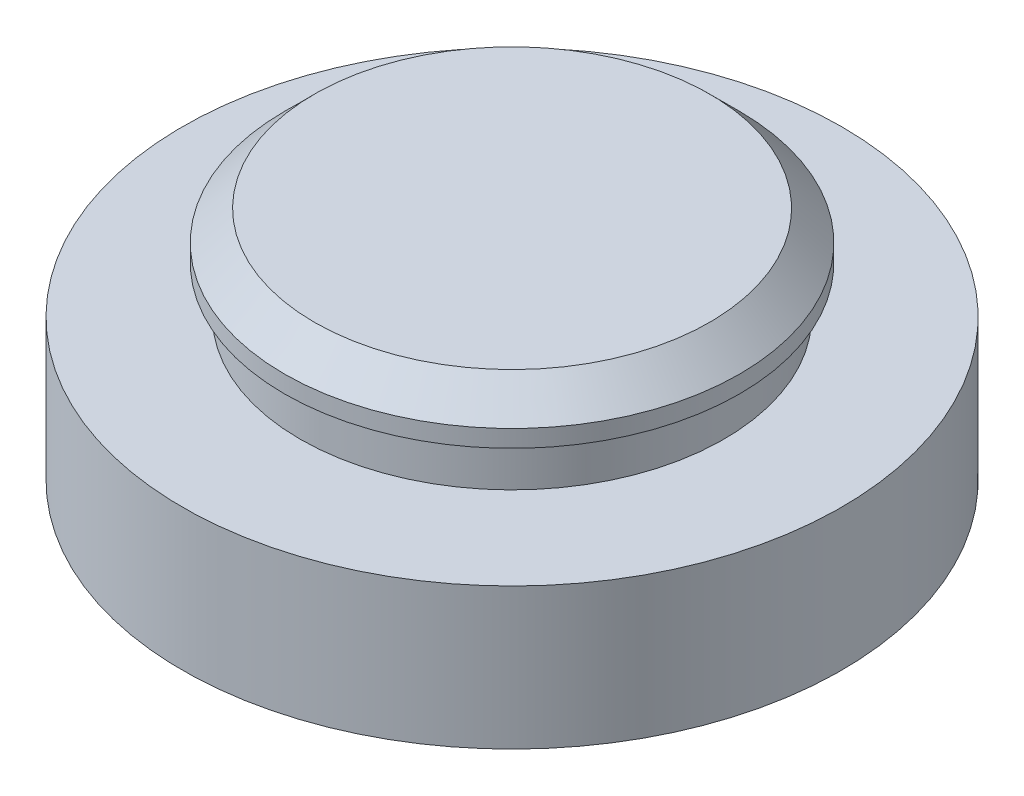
from build123d import *

# Parameters (mm, degrees)
SKETCH1_R           = 13.5
BOSS_EXTRUDE1_DEPTH = 3
SKETCH2_R           = 14.5
BOSS_EXTRUDE2_DEPTH = 3
CHAMFER1_SIZE       = 1.905
SKETCH3_R           = 21
BOSS_EXTRUDE3_DEPTH = 9
SKETCH4_R           = 9
BOSS_EXTRUDE4_DEPTH = 7
FILLET1_R           = 6.35


with BuildPart() as part:
    # Sketch1 → Boss-Extrude1 (new body)
    with BuildSketch(Plane(origin=(0, 0, 0), x_dir=(1, 0, 0), z_dir=(0, 1, 0))):
        with Locations(Location((0, 0, 0), (0, 0, 270))):
            Circle(SKETCH1_R)
    extrude(amount=BOSS_EXTRUDE1_DEPTH)

    # Sketch2 → Boss-Extrude2 (add)
    with BuildSketch(Plane(origin=(0, 3, 0), x_dir=(1, 0, 0), z_dir=(0, 1, 0))):
        with Locations(Location((0, 0, 0), (0, 0, 270))):
            Circle(SKETCH2_R)
    extrude(amount=BOSS_EXTRUDE2_DEPTH)

    # Chamfer1
    chamfer1_edges = [part.edges().sort_by_distance(p)[0] for p in [
        (0, 6, -14.5),
    ]]
    chamfer(chamfer1_edges, length=CHAMFER1_SIZE)

    # Sketch3 → Boss-Extrude3 (add)
    with BuildSketch(Plane.XZ):
        with Locations(Location((0, 0, 0), (0, 0, 270))):
            Circle(SKETCH3_R)
    extrude(amount=BOSS_EXTRUDE3_DEPTH)

    # Sketch4 → Boss-Extrude4 (add)
    with BuildSketch(Plane.XZ.offset(9)):
        with Locations(Location((0, 0, 0), (0, 0, 270))):
            Circle(SKETCH4_R)
    extrude(amount=BOSS_EXTRUDE4_DEPTH)

    # Fillet1
    fillet1_edges = [part.edges().sort_by_distance(p)[0] for p in [
        (0, -16, 9),
    ]]
    fillet(fillet1_edges, radius=FILLET1_R)


solid = part.part
